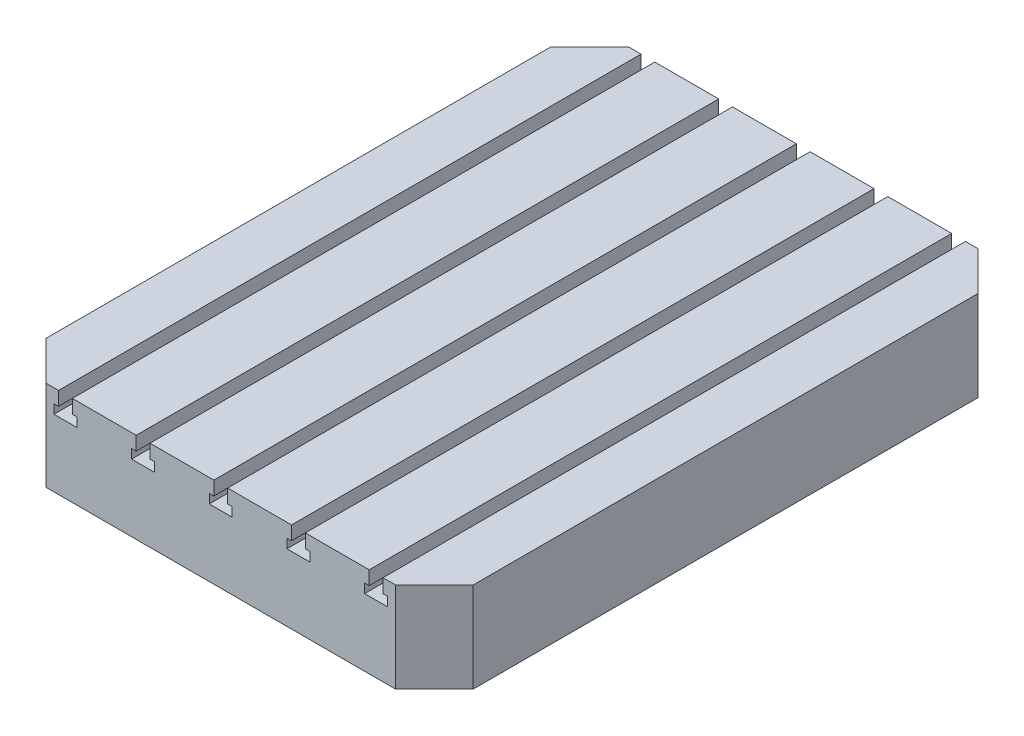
ISO-10303-21;
HEADER;
FILE_DESCRIPTION(('STEP AP214'),'2;1');
FILE_NAME('part.step','',(''),(''),'','','');
FILE_SCHEMA(('AUTOMOTIVE_DESIGN { 1 0 10303 214 1 1 1 1 }'));
ENDSEC;
DATA;
#1=APPLICATION_CONTEXT('core data for automotive mechanical design processes');
#2=APPLICATION_PROTOCOL_DEFINITION('international standard','automotive_design',2000,#1);
#3=PRODUCT_CONTEXT('',#1,'mechanical');
#4=PRODUCT('Part','Part','',(#3));
#5=PRODUCT_RELATED_PRODUCT_CATEGORY('part','',(#4));
#6=PRODUCT_DEFINITION_FORMATION('','',#4);
#7=PRODUCT_DEFINITION_CONTEXT('part definition',#1,'design');
#8=PRODUCT_DEFINITION('design','',#6,#7);
#9=PRODUCT_DEFINITION_SHAPE('','',#8);
#10=(LENGTH_UNIT() NAMED_UNIT(*) SI_UNIT(.MILLI.,.METRE.));
#11=(NAMED_UNIT(*) PLANE_ANGLE_UNIT() SI_UNIT($,.RADIAN.));
#12=(NAMED_UNIT(*) SI_UNIT($,.STERADIAN.) SOLID_ANGLE_UNIT());
#13=UNCERTAINTY_MEASURE_WITH_UNIT(LENGTH_MEASURE(1.E-05),#10,'distance_accuracy_value','');
#14=(GEOMETRIC_REPRESENTATION_CONTEXT(3) GLOBAL_UNCERTAINTY_ASSIGNED_CONTEXT((#13)) GLOBAL_UNIT_ASSIGNED_CONTEXT((#10,
#11,#12)) REPRESENTATION_CONTEXT('',''));
#15=CARTESIAN_POINT('',(0.,0.,0.));
#16=DIRECTION('',(0.,0.,1.));
#17=DIRECTION('',(1.,0.,0.));
#18=AXIS2_PLACEMENT_3D('',#15,#16,#17);
#19=CARTESIAN_POINT('',(-279.4,0.,-381.));
#20=DIRECTION('',(0.,-1.,0.));
#21=DIRECTION('',(0.,0.,-1.));
#22=AXIS2_PLACEMENT_3D('',#19,#20,#21);
#23=PLANE('',#22);
#24=DIRECTION('',(1.,0.,0.));
#25=VECTOR('',#24,1.);
#26=CARTESIAN_POINT('',(-279.4,0.,381.));
#27=LINE('',#26,#25);
#28=CARTESIAN_POINT('',(110.6,0.,381.));
#29=VERTEX_POINT('',#28);
#30=CARTESIAN_POINT('',(194.2,0.,381.));
#31=VERTEX_POINT('',#30);
#32=EDGE_CURVE('E877',#29,#31,#27,.T.);
#33=ORIENTED_EDGE('',*,*,#32,.T.);
#34=DIRECTION('',(0.,0.,1.));
#35=VECTOR('',#34,1.);
#36=CARTESIAN_POINT('',(194.2,0.,-381.));
#37=LINE('',#36,#35);
#38=CARTESIAN_POINT('',(194.2,0.,-381.));
#39=VERTEX_POINT('',#38);
#40=EDGE_CURVE('E422',#39,#31,#37,.T.);
#41=ORIENTED_EDGE('',*,*,#40,.F.);
#42=DIRECTION('',(-1.,0.,0.));
#43=VECTOR('',#42,1.);
#44=CARTESIAN_POINT('',(-279.4,0.,-381.));
#45=LINE('',#44,#43);
#46=CARTESIAN_POINT('',(110.6,0.,-381.));
#47=VERTEX_POINT('',#46);
#48=EDGE_CURVE('E376',#39,#47,#45,.T.);
#49=ORIENTED_EDGE('',*,*,#48,.T.);
#50=DIRECTION('',(0.,0.,1.));
#51=VECTOR('',#50,1.);
#52=CARTESIAN_POINT('',(110.6,0.,-381.));
#53=LINE('',#52,#51);
#54=EDGE_CURVE('E501',#47,#29,#53,.T.);
#55=ORIENTED_EDGE('',*,*,#54,.T.);
#56=EDGE_LOOP('',(#33,#41,#49,#55));
#57=FACE_BOUND('',#56,.T.);
#58=ADVANCED_FACE('F42',(#57),#23,.F.);
#59=CARTESIAN_POINT('',(9.00000000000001,0.,381.));
#60=VERTEX_POINT('',#59);
#61=CARTESIAN_POINT('',(92.6,0.,381.));
#62=VERTEX_POINT('',#61);
#63=EDGE_CURVE('E880',#60,#62,#27,.T.);
#64=ORIENTED_EDGE('',*,*,#63,.T.);
#65=DIRECTION('',(0.,0.,1.));
#66=VECTOR('',#65,1.);
#67=CARTESIAN_POINT('',(92.6,0.,-381.));
#68=LINE('',#67,#66);
#69=CARTESIAN_POINT('',(92.6,0.,-381.));
#70=VERTEX_POINT('',#69);
#71=EDGE_CURVE('E497',#70,#62,#68,.T.);
#72=ORIENTED_EDGE('',*,*,#71,.F.);
#73=CARTESIAN_POINT('',(8.99999999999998,0.,-381.));
#74=VERTEX_POINT('',#73);
#75=EDGE_CURVE('E915',#70,#74,#45,.T.);
#76=ORIENTED_EDGE('',*,*,#75,.T.);
#77=DIRECTION('',(0.,0.,1.));
#78=VECTOR('',#77,1.);
#79=CARTESIAN_POINT('',(8.99999999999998,0.,-381.));
#80=LINE('',#79,#78);
#81=EDGE_CURVE('E581',#74,#60,#80,.T.);
#82=ORIENTED_EDGE('',*,*,#81,.T.);
#83=EDGE_LOOP('',(#64,#72,#76,#82));
#84=FACE_BOUND('',#83,.T.);
#85=ADVANCED_FACE('F960',(#84),#23,.F.);
#86=CARTESIAN_POINT('',(-92.6,0.,381.));
#87=VERTEX_POINT('',#86);
#88=CARTESIAN_POINT('',(-9.00000000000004,0.,381.));
#89=VERTEX_POINT('',#88);
#90=EDGE_CURVE('E885',#87,#89,#27,.T.);
#91=ORIENTED_EDGE('',*,*,#90,.T.);
#92=DIRECTION('',(0.,0.,1.));
#93=VECTOR('',#92,1.);
#94=CARTESIAN_POINT('',(-9.00000000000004,0.,-381.));
#95=LINE('',#94,#93);
#96=CARTESIAN_POINT('',(-9.00000000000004,0.,-381.));
#97=VERTEX_POINT('',#96);
#98=EDGE_CURVE('E577',#97,#89,#95,.T.);
#99=ORIENTED_EDGE('',*,*,#98,.F.);
#100=CARTESIAN_POINT('',(-92.6,0.,-381.));
#101=VERTEX_POINT('',#100);
#102=EDGE_CURVE('E913',#97,#101,#45,.T.);
#103=ORIENTED_EDGE('',*,*,#102,.T.);
#104=DIRECTION('',(0.,0.,1.));
#105=VECTOR('',#104,1.);
#106=CARTESIAN_POINT('',(-92.6,0.,-381.));
#107=LINE('',#106,#105);
#108=EDGE_CURVE('E661',#101,#87,#107,.T.);
#109=ORIENTED_EDGE('',*,*,#108,.T.);
#110=EDGE_LOOP('',(#91,#99,#103,#109));
#111=FACE_BOUND('',#110,.T.);
#112=ADVANCED_FACE('F965',(#111),#23,.F.);
#113=CARTESIAN_POINT('',(-194.2,0.,381.));
#114=VERTEX_POINT('',#113);
#115=CARTESIAN_POINT('',(-110.6,0.,381.));
#116=VERTEX_POINT('',#115);
#117=EDGE_CURVE('E788',#114,#116,#27,.T.);
#118=ORIENTED_EDGE('',*,*,#117,.T.);
#119=DIRECTION('',(0.,0.,1.));
#120=VECTOR('',#119,1.);
#121=CARTESIAN_POINT('',(-110.6,0.,-381.));
#122=LINE('',#121,#120);
#123=CARTESIAN_POINT('',(-110.6,0.,-381.));
#124=VERTEX_POINT('',#123);
#125=EDGE_CURVE('E657',#124,#116,#122,.T.);
#126=ORIENTED_EDGE('',*,*,#125,.F.);
#127=CARTESIAN_POINT('',(-194.2,0.,-381.));
#128=VERTEX_POINT('',#127);
#129=EDGE_CURVE('E910',#124,#128,#45,.T.);
#130=ORIENTED_EDGE('',*,*,#129,.T.);
#131=DIRECTION('',(0.,0.,1.));
#132=VECTOR('',#131,1.);
#133=CARTESIAN_POINT('',(-194.2,0.,-381.));
#134=LINE('',#133,#132);
#135=EDGE_CURVE('E742',#128,#114,#134,.T.);
#136=ORIENTED_EDGE('',*,*,#135,.T.);
#137=EDGE_LOOP('',(#118,#126,#130,#136));
#138=FACE_BOUND('',#137,.T.);
#139=ADVANCED_FACE('F899',(#138),#23,.F.);
#140=CARTESIAN_POINT('',(-212.2,0.,-381.));
#141=VERTEX_POINT('',#140);
#142=CARTESIAN_POINT('',(-228.6,0.,-381.));
#143=VERTEX_POINT('',#142);
#144=EDGE_CURVE('E792',#141,#143,#45,.T.);
#145=ORIENTED_EDGE('',*,*,#144,.T.);
#146=DIRECTION('',(0.707106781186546,0.,-0.707106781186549));
#147=VECTOR('',#146,1.);
#148=CARTESIAN_POINT('',(-228.6,0.,-381.));
#149=LINE('',#148,#147);
#150=CARTESIAN_POINT('',(-279.4,0.,-330.2));
#151=VERTEX_POINT('',#150);
#152=EDGE_CURVE('E804',#143,#151,#149,.F.);
#153=ORIENTED_EDGE('',*,*,#152,.T.);
#154=DIRECTION('',(0.,0.,1.));
#155=VECTOR('',#154,1.);
#156=CARTESIAN_POINT('',(-279.4,0.,381.));
#157=LINE('',#156,#155);
#158=CARTESIAN_POINT('',(-279.4,0.,330.2));
#159=VERTEX_POINT('',#158);
#160=EDGE_CURVE('E741',#151,#159,#157,.T.);
#161=ORIENTED_EDGE('',*,*,#160,.T.);
#162=DIRECTION('',(-0.707106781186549,0.,-0.707106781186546));
#163=VECTOR('',#162,1.);
#164=CARTESIAN_POINT('',(-279.4,0.,330.2));
#165=LINE('',#164,#163);
#166=CARTESIAN_POINT('',(-228.6,0.,381.));
#167=VERTEX_POINT('',#166);
#168=EDGE_CURVE('E801',#159,#167,#165,.F.);
#169=ORIENTED_EDGE('',*,*,#168,.T.);
#170=CARTESIAN_POINT('',(-212.2,0.,381.));
#171=VERTEX_POINT('',#170);
#172=EDGE_CURVE('E784',#167,#171,#27,.T.);
#173=ORIENTED_EDGE('',*,*,#172,.T.);
#174=DIRECTION('',(0.,0.,1.));
#175=VECTOR('',#174,1.);
#176=CARTESIAN_POINT('',(-212.2,0.,-381.));
#177=LINE('',#176,#175);
#178=EDGE_CURVE('E737',#141,#171,#177,.T.);
#179=ORIENTED_EDGE('',*,*,#178,.F.);
#180=EDGE_LOOP('',(#145,#153,#161,#169,#173,#179));
#181=FACE_BOUND('',#180,.T.);
#182=ADVANCED_FACE('F856',(#181),#23,.F.);
#183=CARTESIAN_POINT('',(-279.4,-118.,381.));
#184=DIRECTION('',(-1.,0.,0.));
#185=DIRECTION('',(0.,0.,1.));
#186=AXIS2_PLACEMENT_3D('',#183,#184,#185);
#187=PLANE('',#186);
#188=ORIENTED_EDGE('',*,*,#160,.F.);
#189=DIRECTION('',(0.,-1.,0.));
#190=VECTOR('',#189,1.);
#191=CARTESIAN_POINT('',(-279.4,-118.,-330.2));
#192=LINE('',#191,#190);
#193=CARTESIAN_POINT('',(-279.4,-118.,-330.2));
#194=VERTEX_POINT('',#193);
#195=EDGE_CURVE('E811',#151,#194,#192,.T.);
#196=ORIENTED_EDGE('',*,*,#195,.T.);
#197=DIRECTION('',(0.,0.,1.));
#198=VECTOR('',#197,1.);
#199=CARTESIAN_POINT('',(-279.4,-118.,381.));
#200=LINE('',#199,#198);
#201=CARTESIAN_POINT('',(-279.4,-118.,330.2));
#202=VERTEX_POINT('',#201);
#203=EDGE_CURVE('E763',#194,#202,#200,.T.);
#204=ORIENTED_EDGE('',*,*,#203,.T.);
#205=DIRECTION('',(0.,1.,0.));
#206=VECTOR('',#205,1.);
#207=CARTESIAN_POINT('',(-279.4,-118.,330.2));
#208=LINE('',#207,#206);
#209=EDGE_CURVE('E807',#202,#159,#208,.T.);
#210=ORIENTED_EDGE('',*,*,#209,.T.);
#211=EDGE_LOOP('',(#188,#196,#204,#210));
#212=FACE_BOUND('',#211,.T.);
#213=ADVANCED_FACE('F852',(#212),#187,.T.);
#214=CARTESIAN_POINT('',(-279.4,-118.,-381.));
#215=DIRECTION('',(0.,0.,-1.));
#216=DIRECTION('',(-1.,0.,0.));
#217=AXIS2_PLACEMENT_3D('',#214,#215,#216);
#218=PLANE('',#217);
#219=DIRECTION('',(-1.,0.,0.));
#220=VECTOR('',#219,1.);
#221=CARTESIAN_POINT('',(-279.4,-118.,-381.));
#222=LINE('',#221,#220);
#223=CARTESIAN_POINT('',(228.6,-118.,-381.));
#224=VERTEX_POINT('',#223);
#225=CARTESIAN_POINT('',(-228.6,-118.,-381.));
#226=VERTEX_POINT('',#225);
#227=EDGE_CURVE('E776',#224,#226,#222,.T.);
#228=ORIENTED_EDGE('',*,*,#227,.T.);
#229=DIRECTION('',(0.,1.,0.));
#230=VECTOR('',#229,1.);
#231=CARTESIAN_POINT('',(-228.6,-118.,-381.));
#232=LINE('',#231,#230);
#233=EDGE_CURVE('E797',#226,#143,#232,.T.);
#234=ORIENTED_EDGE('',*,*,#233,.T.);
#235=ORIENTED_EDGE('',*,*,#144,.F.);
#236=DIRECTION('',(0.,-1.,0.));
#237=VECTOR('',#236,1.);
#238=CARTESIAN_POINT('',(-212.2,0.,-381.));
#239=LINE('',#238,#237);
#240=CARTESIAN_POINT('',(-212.2,-18.,-381.));
#241=VERTEX_POINT('',#240);
#242=EDGE_CURVE('E682',#141,#241,#239,.T.);
#243=ORIENTED_EDGE('',*,*,#242,.T.);
#244=DIRECTION('',(-1.,0.,0.));
#245=VECTOR('',#244,1.);
#246=CARTESIAN_POINT('',(-212.2,-18.,-381.));
#247=LINE('',#246,#245);
#248=CARTESIAN_POINT('',(-218.2,-18.,-381.));
#249=VERTEX_POINT('',#248);
#250=EDGE_CURVE('E686',#241,#249,#247,.T.);
#251=ORIENTED_EDGE('',*,*,#250,.T.);
#252=DIRECTION('',(0.,-1.,0.));
#253=VECTOR('',#252,1.);
#254=CARTESIAN_POINT('',(-218.2,-18.,-381.));
#255=LINE('',#254,#253);
#256=CARTESIAN_POINT('',(-218.2,-30.,-381.));
#257=VERTEX_POINT('',#256);
#258=EDGE_CURVE('E691',#249,#257,#255,.T.);
#259=ORIENTED_EDGE('',*,*,#258,.T.);
#260=DIRECTION('',(1.,0.,0.));
#261=VECTOR('',#260,1.);
#262=CARTESIAN_POINT('',(-218.2,-30.,-381.));
#263=LINE('',#262,#261);
#264=CARTESIAN_POINT('',(-188.2,-30.,-381.));
#265=VERTEX_POINT('',#264);
#266=EDGE_CURVE('E695',#257,#265,#263,.T.);
#267=ORIENTED_EDGE('',*,*,#266,.T.);
#268=DIRECTION('',(0.,1.,0.));
#269=VECTOR('',#268,1.);
#270=CARTESIAN_POINT('',(-188.2,-18.,-381.));
#271=LINE('',#270,#269);
#272=CARTESIAN_POINT('',(-188.2,-18.,-381.));
#273=VERTEX_POINT('',#272);
#274=EDGE_CURVE('E699',#265,#273,#271,.T.);
#275=ORIENTED_EDGE('',*,*,#274,.T.);
#276=DIRECTION('',(-1.,0.,0.));
#277=VECTOR('',#276,1.);
#278=CARTESIAN_POINT('',(-194.2,-18.,-381.));
#279=LINE('',#278,#277);
#280=CARTESIAN_POINT('',(-194.2,-18.,-381.));
#281=VERTEX_POINT('',#280);
#282=EDGE_CURVE('E703',#273,#281,#279,.T.);
#283=ORIENTED_EDGE('',*,*,#282,.T.);
#284=DIRECTION('',(0.,1.,0.));
#285=VECTOR('',#284,1.);
#286=CARTESIAN_POINT('',(-194.2,0.,-381.));
#287=LINE('',#286,#285);
#288=EDGE_CURVE('E707',#281,#128,#287,.T.);
#289=ORIENTED_EDGE('',*,*,#288,.T.);
#290=ORIENTED_EDGE('',*,*,#129,.F.);
#291=DIRECTION('',(0.,-1.,0.));
#292=VECTOR('',#291,1.);
#293=CARTESIAN_POINT('',(-110.6,0.,-381.));
#294=LINE('',#293,#292);
#295=CARTESIAN_POINT('',(-110.6,-18.,-381.));
#296=VERTEX_POINT('',#295);
#297=EDGE_CURVE('E602',#124,#296,#294,.T.);
#298=ORIENTED_EDGE('',*,*,#297,.T.);
#299=DIRECTION('',(-1.,0.,0.));
#300=VECTOR('',#299,1.);
#301=CARTESIAN_POINT('',(-110.6,-18.,-381.));
#302=LINE('',#301,#300);
#303=CARTESIAN_POINT('',(-116.6,-18.,-381.));
#304=VERTEX_POINT('',#303);
#305=EDGE_CURVE('E606',#296,#304,#302,.T.);
#306=ORIENTED_EDGE('',*,*,#305,.T.);
#307=DIRECTION('',(0.,-1.,0.));
#308=VECTOR('',#307,1.);
#309=CARTESIAN_POINT('',(-116.6,-18.,-381.));
#310=LINE('',#309,#308);
#311=CARTESIAN_POINT('',(-116.6,-30.,-381.));
#312=VERTEX_POINT('',#311);
#313=EDGE_CURVE('E611',#304,#312,#310,.T.);
#314=ORIENTED_EDGE('',*,*,#313,.T.);
#315=DIRECTION('',(1.,0.,0.));
#316=VECTOR('',#315,1.);
#317=CARTESIAN_POINT('',(-116.6,-30.,-381.));
#318=LINE('',#317,#316);
#319=CARTESIAN_POINT('',(-86.6,-30.,-381.));
#320=VERTEX_POINT('',#319);
#321=EDGE_CURVE('E615',#312,#320,#318,.T.);
#322=ORIENTED_EDGE('',*,*,#321,.T.);
#323=DIRECTION('',(0.,1.,0.));
#324=VECTOR('',#323,1.);
#325=CARTESIAN_POINT('',(-86.6,-18.,-381.));
#326=LINE('',#325,#324);
#327=CARTESIAN_POINT('',(-86.6,-18.,-381.));
#328=VERTEX_POINT('',#327);
#329=EDGE_CURVE('E619',#320,#328,#326,.T.);
#330=ORIENTED_EDGE('',*,*,#329,.T.);
#331=DIRECTION('',(-1.,0.,0.));
#332=VECTOR('',#331,1.);
#333=CARTESIAN_POINT('',(-92.6,-18.,-381.));
#334=LINE('',#333,#332);
#335=CARTESIAN_POINT('',(-92.6,-18.,-381.));
#336=VERTEX_POINT('',#335);
#337=EDGE_CURVE('E623',#328,#336,#334,.T.);
#338=ORIENTED_EDGE('',*,*,#337,.T.);
#339=DIRECTION('',(0.,1.,0.));
#340=VECTOR('',#339,1.);
#341=CARTESIAN_POINT('',(-92.6,0.,-381.));
#342=LINE('',#341,#340);
#343=EDGE_CURVE('E627',#336,#101,#342,.T.);
#344=ORIENTED_EDGE('',*,*,#343,.T.);
#345=ORIENTED_EDGE('',*,*,#102,.F.);
#346=DIRECTION('',(0.,-1.,0.));
#347=VECTOR('',#346,1.);
#348=CARTESIAN_POINT('',(-9.00000000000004,0.,-381.));
#349=LINE('',#348,#347);
#350=CARTESIAN_POINT('',(-9.00000000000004,-18.,-381.));
#351=VERTEX_POINT('',#350);
#352=EDGE_CURVE('E522',#97,#351,#349,.T.);
#353=ORIENTED_EDGE('',*,*,#352,.T.);
#354=DIRECTION('',(-1.,0.,0.));
#355=VECTOR('',#354,1.);
#356=CARTESIAN_POINT('',(-9.00000000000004,-18.,-381.));
#357=LINE('',#356,#355);
#358=CARTESIAN_POINT('',(-15.,-18.,-381.));
#359=VERTEX_POINT('',#358);
#360=EDGE_CURVE('E526',#351,#359,#357,.T.);
#361=ORIENTED_EDGE('',*,*,#360,.T.);
#362=DIRECTION('',(0.,-1.,0.));
#363=VECTOR('',#362,1.);
#364=CARTESIAN_POINT('',(-15.,-18.,-381.));
#365=LINE('',#364,#363);
#366=CARTESIAN_POINT('',(-15.,-30.,-381.));
#367=VERTEX_POINT('',#366);
#368=EDGE_CURVE('E531',#359,#367,#365,.T.);
#369=ORIENTED_EDGE('',*,*,#368,.T.);
#370=DIRECTION('',(1.,0.,0.));
#371=VECTOR('',#370,1.);
#372=CARTESIAN_POINT('',(-15.,-30.,-381.));
#373=LINE('',#372,#371);
#374=CARTESIAN_POINT('',(15.,-30.,-381.));
#375=VERTEX_POINT('',#374);
#376=EDGE_CURVE('E535',#367,#375,#373,.T.);
#377=ORIENTED_EDGE('',*,*,#376,.T.);
#378=DIRECTION('',(0.,1.,0.));
#379=VECTOR('',#378,1.);
#380=CARTESIAN_POINT('',(15.,-18.,-381.));
#381=LINE('',#380,#379);
#382=CARTESIAN_POINT('',(15.,-18.,-381.));
#383=VERTEX_POINT('',#382);
#384=EDGE_CURVE('E539',#375,#383,#381,.T.);
#385=ORIENTED_EDGE('',*,*,#384,.T.);
#386=DIRECTION('',(-1.,0.,0.));
#387=VECTOR('',#386,1.);
#388=CARTESIAN_POINT('',(8.99999999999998,-18.,-381.));
#389=LINE('',#388,#387);
#390=CARTESIAN_POINT('',(8.99999999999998,-18.,-381.));
#391=VERTEX_POINT('',#390);
#392=EDGE_CURVE('E543',#383,#391,#389,.T.);
#393=ORIENTED_EDGE('',*,*,#392,.T.);
#394=DIRECTION('',(0.,1.,0.));
#395=VECTOR('',#394,1.);
#396=CARTESIAN_POINT('',(8.99999999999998,0.,-381.));
#397=LINE('',#396,#395);
#398=EDGE_CURVE('E547',#391,#74,#397,.T.);
#399=ORIENTED_EDGE('',*,*,#398,.T.);
#400=ORIENTED_EDGE('',*,*,#75,.F.);
#401=DIRECTION('',(0.,-1.,0.));
#402=VECTOR('',#401,1.);
#403=CARTESIAN_POINT('',(92.6,0.,-381.));
#404=LINE('',#403,#402);
#405=CARTESIAN_POINT('',(92.6,-18.,-381.));
#406=VERTEX_POINT('',#405);
#407=EDGE_CURVE('E444',#70,#406,#404,.T.);
#408=ORIENTED_EDGE('',*,*,#407,.T.);
#409=DIRECTION('',(-1.,0.,0.));
#410=VECTOR('',#409,1.);
#411=CARTESIAN_POINT('',(92.6,-18.,-381.));
#412=LINE('',#411,#410);
#413=CARTESIAN_POINT('',(86.6,-18.,-381.));
#414=VERTEX_POINT('',#413);
#415=EDGE_CURVE('E448',#406,#414,#412,.T.);
#416=ORIENTED_EDGE('',*,*,#415,.T.);
#417=DIRECTION('',(0.,-1.,0.));
#418=VECTOR('',#417,1.);
#419=CARTESIAN_POINT('',(86.6,-18.,-381.));
#420=LINE('',#419,#418);
#421=CARTESIAN_POINT('',(86.6,-30.,-381.));
#422=VERTEX_POINT('',#421);
#423=EDGE_CURVE('E452',#414,#422,#420,.T.);
#424=ORIENTED_EDGE('',*,*,#423,.T.);
#425=DIRECTION('',(1.,0.,0.));
#426=VECTOR('',#425,1.);
#427=CARTESIAN_POINT('',(86.6,-30.,-381.));
#428=LINE('',#427,#426);
#429=CARTESIAN_POINT('',(116.6,-30.,-381.));
#430=VERTEX_POINT('',#429);
#431=EDGE_CURVE('E456',#422,#430,#428,.T.);
#432=ORIENTED_EDGE('',*,*,#431,.T.);
#433=DIRECTION('',(0.,1.,0.));
#434=VECTOR('',#433,1.);
#435=CARTESIAN_POINT('',(116.6,-18.,-381.));
#436=LINE('',#435,#434);
#437=CARTESIAN_POINT('',(116.6,-18.,-381.));
#438=VERTEX_POINT('',#437);
#439=EDGE_CURVE('E460',#430,#438,#436,.T.);
#440=ORIENTED_EDGE('',*,*,#439,.T.);
#441=DIRECTION('',(-1.,0.,0.));
#442=VECTOR('',#441,1.);
#443=CARTESIAN_POINT('',(110.6,-18.,-381.));
#444=LINE('',#443,#442);
#445=CARTESIAN_POINT('',(110.6,-18.,-381.));
#446=VERTEX_POINT('',#445);
#447=EDGE_CURVE('E464',#438,#446,#444,.T.);
#448=ORIENTED_EDGE('',*,*,#447,.T.);
#449=DIRECTION('',(0.,1.,0.));
#450=VECTOR('',#449,1.);
#451=CARTESIAN_POINT('',(110.6,0.,-381.));
#452=LINE('',#451,#450);
#453=EDGE_CURVE('E468',#446,#47,#452,.T.);
#454=ORIENTED_EDGE('',*,*,#453,.T.);
#455=ORIENTED_EDGE('',*,*,#48,.F.);
#456=DIRECTION('',(0.,-1.,0.));
#457=VECTOR('',#456,1.);
#458=CARTESIAN_POINT('',(194.2,0.,-381.));
#459=LINE('',#458,#457);
#460=CARTESIAN_POINT('',(194.2,-18.,-381.));
#461=VERTEX_POINT('',#460);
#462=EDGE_CURVE('E352',#39,#461,#459,.T.);
#463=ORIENTED_EDGE('',*,*,#462,.T.);
#464=DIRECTION('',(-1.,0.,0.));
#465=VECTOR('',#464,1.);
#466=CARTESIAN_POINT('',(194.2,-18.,-381.));
#467=LINE('',#466,#465);
#468=CARTESIAN_POINT('',(188.2,-18.,-381.));
#469=VERTEX_POINT('',#468);
#470=EDGE_CURVE('E364',#461,#469,#467,.T.);
#471=ORIENTED_EDGE('',*,*,#470,.T.);
#472=DIRECTION('',(0.,-1.,0.));
#473=VECTOR('',#472,1.);
#474=CARTESIAN_POINT('',(188.2,-18.,-381.));
#475=LINE('',#474,#473);
#476=CARTESIAN_POINT('',(188.2,-30.,-381.));
#477=VERTEX_POINT('',#476);
#478=EDGE_CURVE('E370',#469,#477,#475,.T.);
#479=ORIENTED_EDGE('',*,*,#478,.T.);
#480=DIRECTION('',(1.,0.,0.));
#481=VECTOR('',#480,1.);
#482=CARTESIAN_POINT('',(188.2,-30.,-381.));
#483=LINE('',#482,#481);
#484=CARTESIAN_POINT('',(218.2,-30.,-381.));
#485=VERTEX_POINT('',#484);
#486=EDGE_CURVE('E388',#477,#485,#483,.T.);
#487=ORIENTED_EDGE('',*,*,#486,.T.);
#488=DIRECTION('',(0.,1.,0.));
#489=VECTOR('',#488,1.);
#490=CARTESIAN_POINT('',(218.2,-18.,-381.));
#491=LINE('',#490,#489);
#492=CARTESIAN_POINT('',(218.2,-18.,-381.));
#493=VERTEX_POINT('',#492);
#494=EDGE_CURVE('E392',#485,#493,#491,.T.);
#495=ORIENTED_EDGE('',*,*,#494,.T.);
#496=DIRECTION('',(-1.,0.,0.));
#497=VECTOR('',#496,1.);
#498=CARTESIAN_POINT('',(212.2,-18.,-381.));
#499=LINE('',#498,#497);
#500=CARTESIAN_POINT('',(212.2,-18.,-381.));
#501=VERTEX_POINT('',#500);
#502=EDGE_CURVE('E396',#493,#501,#499,.T.);
#503=ORIENTED_EDGE('',*,*,#502,.T.);
#504=DIRECTION('',(0.,1.,0.));
#505=VECTOR('',#504,1.);
#506=CARTESIAN_POINT('',(212.2,0.,-381.));
#507=LINE('',#506,#505);
#508=CARTESIAN_POINT('',(212.2,0.,-381.));
#509=VERTEX_POINT('',#508);
#510=EDGE_CURVE('E361',#501,#509,#507,.T.);
#511=ORIENTED_EDGE('',*,*,#510,.T.);
#512=CARTESIAN_POINT('',(228.6,0.,-381.));
#513=VERTEX_POINT('',#512);
#514=EDGE_CURVE('E768',#513,#509,#45,.T.);
#515=ORIENTED_EDGE('',*,*,#514,.F.);
#516=DIRECTION('',(0.,-1.,0.));
#517=VECTOR('',#516,1.);
#518=CARTESIAN_POINT('',(228.6,-118.,-381.));
#519=LINE('',#518,#517);
#520=EDGE_CURVE('E779',#513,#224,#519,.T.);
#521=ORIENTED_EDGE('',*,*,#520,.T.);
#522=EDGE_LOOP('',(#228,#234,#235,#243,#251,#259,#267,#275,#283,#289,#290,#298,#306,#314,#322,
#330,#338,#344,#345,#353,#361,#369,#377,#385,#393,#399,#400,#408,#416,#424,#432,#440,#448,#454,
#455,#463,#471,#479,#487,#495,#503,#511,#515,#521));
#523=FACE_BOUND('',#522,.T.);
#524=ADVANCED_FACE('F374',(#523),#218,.T.);
#525=CARTESIAN_POINT('',(279.4,-118.,381.));
#526=DIRECTION('',(1.,0.,0.));
#527=DIRECTION('',(0.,0.,-1.));
#528=AXIS2_PLACEMENT_3D('',#525,#526,#527);
#529=PLANE('',#528);
#530=DIRECTION('',(0.,0.,-1.));
#531=VECTOR('',#530,1.);
#532=CARTESIAN_POINT('',(279.4,-118.,381.));
#533=LINE('',#532,#531);
#534=CARTESIAN_POINT('',(279.4,-118.,330.2));
#535=VERTEX_POINT('',#534);
#536=CARTESIAN_POINT('',(279.4,-118.,-330.2));
#537=VERTEX_POINT('',#536);
#538=EDGE_CURVE('E772',#535,#537,#533,.T.);
#539=ORIENTED_EDGE('',*,*,#538,.T.);
#540=DIRECTION('',(0.,1.,0.));
#541=VECTOR('',#540,1.);
#542=CARTESIAN_POINT('',(279.4,-118.,-330.2));
#543=LINE('',#542,#541);
#544=CARTESIAN_POINT('',(279.4,0.,-330.2));
#545=VERTEX_POINT('',#544);
#546=EDGE_CURVE('E829',#537,#545,#543,.T.);
#547=ORIENTED_EDGE('',*,*,#546,.T.);
#548=DIRECTION('',(0.,0.,-1.));
#549=VECTOR('',#548,1.);
#550=CARTESIAN_POINT('',(279.4,0.,381.));
#551=LINE('',#550,#549);
#552=CARTESIAN_POINT('',(279.4,0.,330.2));
#553=VERTEX_POINT('',#552);
#554=EDGE_CURVE('E787',#553,#545,#551,.T.);
#555=ORIENTED_EDGE('',*,*,#554,.F.);
#556=DIRECTION('',(0.,-1.,0.));
#557=VECTOR('',#556,1.);
#558=CARTESIAN_POINT('',(279.4,-118.,330.2));
#559=LINE('',#558,#557);
#560=EDGE_CURVE('E826',#553,#535,#559,.T.);
#561=ORIENTED_EDGE('',*,*,#560,.T.);
#562=EDGE_LOOP('',(#539,#547,#555,#561));
#563=FACE_BOUND('',#562,.T.);
#564=ADVANCED_FACE('F869',(#563),#529,.T.);
#565=CARTESIAN_POINT('',(-279.4,-118.,381.));
#566=DIRECTION('',(0.,0.,1.));
#567=DIRECTION('',(1.,0.,0.));
#568=AXIS2_PLACEMENT_3D('',#565,#566,#567);
#569=PLANE('',#568);
#570=DIRECTION('',(1.,0.,0.));
#571=VECTOR('',#570,1.);
#572=CARTESIAN_POINT('',(-279.4,-118.,381.));
#573=LINE('',#572,#571);
#574=CARTESIAN_POINT('',(-228.6,-118.,381.));
#575=VERTEX_POINT('',#574);
#576=CARTESIAN_POINT('',(228.6,-118.,381.));
#577=VERTEX_POINT('',#576);
#578=EDGE_CURVE('E767',#575,#577,#573,.T.);
#579=ORIENTED_EDGE('',*,*,#578,.T.);
#580=DIRECTION('',(0.,1.,0.));
#581=VECTOR('',#580,1.);
#582=CARTESIAN_POINT('',(228.6,-118.,381.));
#583=LINE('',#582,#581);
#584=CARTESIAN_POINT('',(228.6,0.,381.));
#585=VERTEX_POINT('',#584);
#586=EDGE_CURVE('E11',#577,#585,#583,.T.);
#587=ORIENTED_EDGE('',*,*,#586,.T.);
#588=CARTESIAN_POINT('',(212.2,0.,381.));
#589=VERTEX_POINT('',#588);
#590=EDGE_CURVE('E783',#589,#585,#27,.T.);
#591=ORIENTED_EDGE('',*,*,#590,.F.);
#592=DIRECTION('',(0.,1.,0.));
#593=VECTOR('',#592,1.);
#594=CARTESIAN_POINT('',(212.2,0.,381.));
#595=LINE('',#594,#593);
#596=CARTESIAN_POINT('',(212.2,-18.,381.));
#597=VERTEX_POINT('',#596);
#598=EDGE_CURVE('E378',#597,#589,#595,.T.);
#599=ORIENTED_EDGE('',*,*,#598,.F.);
#600=DIRECTION('',(-1.,0.,0.));
#601=VECTOR('',#600,1.);
#602=CARTESIAN_POINT('',(212.2,-18.,381.));
#603=LINE('',#602,#601);
#604=CARTESIAN_POINT('',(218.2,-18.,381.));
#605=VERTEX_POINT('',#604);
#606=EDGE_CURVE('E383',#605,#597,#603,.T.);
#607=ORIENTED_EDGE('',*,*,#606,.F.);
#608=DIRECTION('',(0.,1.,0.));
#609=VECTOR('',#608,1.);
#610=CARTESIAN_POINT('',(218.2,-18.,381.));
#611=LINE('',#610,#609);
#612=CARTESIAN_POINT('',(218.2,-30.,381.));
#613=VERTEX_POINT('',#612);
#614=EDGE_CURVE('E416',#613,#605,#611,.T.);
#615=ORIENTED_EDGE('',*,*,#614,.F.);
#616=DIRECTION('',(1.,0.,0.));
#617=VECTOR('',#616,1.);
#618=CARTESIAN_POINT('',(188.2,-30.,381.));
#619=LINE('',#618,#617);
#620=CARTESIAN_POINT('',(188.2,-30.,381.));
#621=VERTEX_POINT('',#620);
#622=EDGE_CURVE('E412',#621,#613,#619,.T.);
#623=ORIENTED_EDGE('',*,*,#622,.F.);
#624=DIRECTION('',(0.,-1.,0.));
#625=VECTOR('',#624,1.);
#626=CARTESIAN_POINT('',(188.2,-18.,381.));
#627=LINE('',#626,#625);
#628=CARTESIAN_POINT('',(188.2,-18.,381.));
#629=VERTEX_POINT('',#628);
#630=EDGE_CURVE('E408',#629,#621,#627,.T.);
#631=ORIENTED_EDGE('',*,*,#630,.F.);
#632=DIRECTION('',(-1.,0.,0.));
#633=VECTOR('',#632,1.);
#634=CARTESIAN_POINT('',(194.2,-18.,381.));
#635=LINE('',#634,#633);
#636=CARTESIAN_POINT('',(194.2,-18.,381.));
#637=VERTEX_POINT('',#636);
#638=EDGE_CURVE('E405',#637,#629,#635,.T.);
#639=ORIENTED_EDGE('',*,*,#638,.F.);
#640=DIRECTION('',(0.,-1.,0.));
#641=VECTOR('',#640,1.);
#642=CARTESIAN_POINT('',(194.2,0.,381.));
#643=LINE('',#642,#641);
#644=EDGE_CURVE('E355',#31,#637,#643,.T.);
#645=ORIENTED_EDGE('',*,*,#644,.F.);
#646=ORIENTED_EDGE('',*,*,#32,.F.);
#647=DIRECTION('',(0.,1.,0.));
#648=VECTOR('',#647,1.);
#649=CARTESIAN_POINT('',(110.6,0.,381.));
#650=LINE('',#649,#648);
#651=CARTESIAN_POINT('',(110.6,-18.,381.));
#652=VERTEX_POINT('',#651);
#653=EDGE_CURVE('E449',#652,#29,#650,.T.);
#654=ORIENTED_EDGE('',*,*,#653,.F.);
#655=DIRECTION('',(-1.,0.,0.));
#656=VECTOR('',#655,1.);
#657=CARTESIAN_POINT('',(110.6,-18.,381.));
#658=LINE('',#657,#656);
#659=CARTESIAN_POINT('',(116.6,-18.,381.));
#660=VERTEX_POINT('',#659);
#661=EDGE_CURVE('E491',#660,#652,#658,.T.);
#662=ORIENTED_EDGE('',*,*,#661,.F.);
#663=DIRECTION('',(0.,1.,0.));
#664=VECTOR('',#663,1.);
#665=CARTESIAN_POINT('',(116.6,-18.,381.));
#666=LINE('',#665,#664);
#667=CARTESIAN_POINT('',(116.6,-30.,381.));
#668=VERTEX_POINT('',#667);
#669=EDGE_CURVE('E487',#668,#660,#666,.T.);
#670=ORIENTED_EDGE('',*,*,#669,.F.);
#671=DIRECTION('',(1.,0.,0.));
#672=VECTOR('',#671,1.);
#673=CARTESIAN_POINT('',(86.6,-30.,381.));
#674=LINE('',#673,#672);
#675=CARTESIAN_POINT('',(86.6,-30.,381.));
#676=VERTEX_POINT('',#675);
#677=EDGE_CURVE('E483',#676,#668,#674,.T.);
#678=ORIENTED_EDGE('',*,*,#677,.F.);
#679=DIRECTION('',(0.,-1.,0.));
#680=VECTOR('',#679,1.);
#681=CARTESIAN_POINT('',(86.6,-18.,381.));
#682=LINE('',#681,#680);
#683=CARTESIAN_POINT('',(86.6,-18.,381.));
#684=VERTEX_POINT('',#683);
#685=EDGE_CURVE('E479',#684,#676,#682,.T.);
#686=ORIENTED_EDGE('',*,*,#685,.F.);
#687=DIRECTION('',(-1.,0.,0.));
#688=VECTOR('',#687,1.);
#689=CARTESIAN_POINT('',(92.6,-18.,381.));
#690=LINE('',#689,#688);
#691=CARTESIAN_POINT('',(92.6,-18.,381.));
#692=VERTEX_POINT('',#691);
#693=EDGE_CURVE('E475',#692,#684,#690,.T.);
#694=ORIENTED_EDGE('',*,*,#693,.F.);
#695=DIRECTION('',(0.,-1.,0.));
#696=VECTOR('',#695,1.);
#697=CARTESIAN_POINT('',(92.6,0.,381.));
#698=LINE('',#697,#696);
#699=EDGE_CURVE('E425',#62,#692,#698,.T.);
#700=ORIENTED_EDGE('',*,*,#699,.F.);
#701=ORIENTED_EDGE('',*,*,#63,.F.);
#702=DIRECTION('',(0.,1.,0.));
#703=VECTOR('',#702,1.);
#704=CARTESIAN_POINT('',(8.99999999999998,0.,381.));
#705=LINE('',#704,#703);
#706=CARTESIAN_POINT('',(8.99999999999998,-18.,381.));
#707=VERTEX_POINT('',#706);
#708=EDGE_CURVE('E527',#707,#60,#705,.T.);
#709=ORIENTED_EDGE('',*,*,#708,.F.);
#710=DIRECTION('',(-1.,0.,0.));
#711=VECTOR('',#710,1.);
#712=CARTESIAN_POINT('',(8.99999999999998,-18.,381.));
#713=LINE('',#712,#711);
#714=CARTESIAN_POINT('',(15.,-18.,381.));
#715=VERTEX_POINT('',#714);
#716=EDGE_CURVE('E571',#715,#707,#713,.T.);
#717=ORIENTED_EDGE('',*,*,#716,.F.);
#718=DIRECTION('',(0.,1.,0.));
#719=VECTOR('',#718,1.);
#720=CARTESIAN_POINT('',(15.,-18.,381.));
#721=LINE('',#720,#719);
#722=CARTESIAN_POINT('',(15.,-30.,381.));
#723=VERTEX_POINT('',#722);
#724=EDGE_CURVE('E567',#723,#715,#721,.T.);
#725=ORIENTED_EDGE('',*,*,#724,.F.);
#726=DIRECTION('',(1.,0.,0.));
#727=VECTOR('',#726,1.);
#728=CARTESIAN_POINT('',(-15.,-30.,381.));
#729=LINE('',#728,#727);
#730=CARTESIAN_POINT('',(-15.,-30.,381.));
#731=VERTEX_POINT('',#730);
#732=EDGE_CURVE('E563',#731,#723,#729,.T.);
#733=ORIENTED_EDGE('',*,*,#732,.F.);
#734=DIRECTION('',(0.,-1.,0.));
#735=VECTOR('',#734,1.);
#736=CARTESIAN_POINT('',(-15.,-18.,381.));
#737=LINE('',#736,#735);
#738=CARTESIAN_POINT('',(-15.,-18.,381.));
#739=VERTEX_POINT('',#738);
#740=EDGE_CURVE('E559',#739,#731,#737,.T.);
#741=ORIENTED_EDGE('',*,*,#740,.F.);
#742=DIRECTION('',(-1.,0.,0.));
#743=VECTOR('',#742,1.);
#744=CARTESIAN_POINT('',(-9.00000000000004,-18.,381.));
#745=LINE('',#744,#743);
#746=CARTESIAN_POINT('',(-9.00000000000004,-18.,381.));
#747=VERTEX_POINT('',#746);
#748=EDGE_CURVE('E555',#747,#739,#745,.T.);
#749=ORIENTED_EDGE('',*,*,#748,.F.);
#750=DIRECTION('',(0.,-1.,0.));
#751=VECTOR('',#750,1.);
#752=CARTESIAN_POINT('',(-9.00000000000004,0.,381.));
#753=LINE('',#752,#751);
#754=EDGE_CURVE('E500',#89,#747,#753,.T.);
#755=ORIENTED_EDGE('',*,*,#754,.F.);
#756=ORIENTED_EDGE('',*,*,#90,.F.);
#757=DIRECTION('',(0.,1.,0.));
#758=VECTOR('',#757,1.);
#759=CARTESIAN_POINT('',(-92.6,0.,381.));
#760=LINE('',#759,#758);
#761=CARTESIAN_POINT('',(-92.6,-18.,381.));
#762=VERTEX_POINT('',#761);
#763=EDGE_CURVE('E607',#762,#87,#760,.T.);
#764=ORIENTED_EDGE('',*,*,#763,.F.);
#765=DIRECTION('',(-1.,0.,0.));
#766=VECTOR('',#765,1.);
#767=CARTESIAN_POINT('',(-92.6,-18.,381.));
#768=LINE('',#767,#766);
#769=CARTESIAN_POINT('',(-86.6,-18.,381.));
#770=VERTEX_POINT('',#769);
#771=EDGE_CURVE('E651',#770,#762,#768,.T.);
#772=ORIENTED_EDGE('',*,*,#771,.F.);
#773=DIRECTION('',(0.,1.,0.));
#774=VECTOR('',#773,1.);
#775=CARTESIAN_POINT('',(-86.6,-18.,381.));
#776=LINE('',#775,#774);
#777=CARTESIAN_POINT('',(-86.6,-30.,381.));
#778=VERTEX_POINT('',#777);
#779=EDGE_CURVE('E647',#778,#770,#776,.T.);
#780=ORIENTED_EDGE('',*,*,#779,.F.);
#781=DIRECTION('',(1.,0.,0.));
#782=VECTOR('',#781,1.);
#783=CARTESIAN_POINT('',(-116.6,-30.,381.));
#784=LINE('',#783,#782);
#785=CARTESIAN_POINT('',(-116.6,-30.,381.));
#786=VERTEX_POINT('',#785);
#787=EDGE_CURVE('E643',#786,#778,#784,.T.);
#788=ORIENTED_EDGE('',*,*,#787,.F.);
#789=DIRECTION('',(0.,-1.,0.));
#790=VECTOR('',#789,1.);
#791=CARTESIAN_POINT('',(-116.6,-18.,381.));
#792=LINE('',#791,#790);
#793=CARTESIAN_POINT('',(-116.6,-18.,381.));
#794=VERTEX_POINT('',#793);
#795=EDGE_CURVE('E639',#794,#786,#792,.T.);
#796=ORIENTED_EDGE('',*,*,#795,.F.);
#797=DIRECTION('',(-1.,0.,0.));
#798=VECTOR('',#797,1.);
#799=CARTESIAN_POINT('',(-110.6,-18.,381.));
#800=LINE('',#799,#798);
#801=CARTESIAN_POINT('',(-110.6,-18.,381.));
#802=VERTEX_POINT('',#801);
#803=EDGE_CURVE('E635',#802,#794,#800,.T.);
#804=ORIENTED_EDGE('',*,*,#803,.F.);
#805=DIRECTION('',(0.,-1.,0.));
#806=VECTOR('',#805,1.);
#807=CARTESIAN_POINT('',(-110.6,0.,381.));
#808=LINE('',#807,#806);
#809=EDGE_CURVE('E580',#116,#802,#808,.T.);
#810=ORIENTED_EDGE('',*,*,#809,.F.);
#811=ORIENTED_EDGE('',*,*,#117,.F.);
#812=DIRECTION('',(0.,1.,0.));
#813=VECTOR('',#812,1.);
#814=CARTESIAN_POINT('',(-194.2,0.,381.));
#815=LINE('',#814,#813);
#816=CARTESIAN_POINT('',(-194.2,-18.,381.));
#817=VERTEX_POINT('',#816);
#818=EDGE_CURVE('E687',#817,#114,#815,.T.);
#819=ORIENTED_EDGE('',*,*,#818,.F.);
#820=DIRECTION('',(-1.,0.,0.));
#821=VECTOR('',#820,1.);
#822=CARTESIAN_POINT('',(-194.2,-18.,381.));
#823=LINE('',#822,#821);
#824=CARTESIAN_POINT('',(-188.2,-18.,381.));
#825=VERTEX_POINT('',#824);
#826=EDGE_CURVE('E731',#825,#817,#823,.T.);
#827=ORIENTED_EDGE('',*,*,#826,.F.);
#828=DIRECTION('',(0.,1.,0.));
#829=VECTOR('',#828,1.);
#830=CARTESIAN_POINT('',(-188.2,-18.,381.));
#831=LINE('',#830,#829);
#832=CARTESIAN_POINT('',(-188.2,-30.,381.));
#833=VERTEX_POINT('',#832);
#834=EDGE_CURVE('E727',#833,#825,#831,.T.);
#835=ORIENTED_EDGE('',*,*,#834,.F.);
#836=DIRECTION('',(1.,0.,0.));
#837=VECTOR('',#836,1.);
#838=CARTESIAN_POINT('',(-218.2,-30.,381.));
#839=LINE('',#838,#837);
#840=CARTESIAN_POINT('',(-218.2,-30.,381.));
#841=VERTEX_POINT('',#840);
#842=EDGE_CURVE('E723',#841,#833,#839,.T.);
#843=ORIENTED_EDGE('',*,*,#842,.F.);
#844=DIRECTION('',(0.,-1.,0.));
#845=VECTOR('',#844,1.);
#846=CARTESIAN_POINT('',(-218.2,-18.,381.));
#847=LINE('',#846,#845);
#848=CARTESIAN_POINT('',(-218.2,-18.,381.));
#849=VERTEX_POINT('',#848);
#850=EDGE_CURVE('E719',#849,#841,#847,.T.);
#851=ORIENTED_EDGE('',*,*,#850,.F.);
#852=DIRECTION('',(-1.,0.,0.));
#853=VECTOR('',#852,1.);
#854=CARTESIAN_POINT('',(-212.2,-18.,381.));
#855=LINE('',#854,#853);
#856=CARTESIAN_POINT('',(-212.2,-18.,381.));
#857=VERTEX_POINT('',#856);
#858=EDGE_CURVE('E715',#857,#849,#855,.T.);
#859=ORIENTED_EDGE('',*,*,#858,.F.);
#860=DIRECTION('',(0.,-1.,0.));
#861=VECTOR('',#860,1.);
#862=CARTESIAN_POINT('',(-212.2,0.,381.));
#863=LINE('',#862,#861);
#864=EDGE_CURVE('E660',#171,#857,#863,.T.);
#865=ORIENTED_EDGE('',*,*,#864,.F.);
#866=ORIENTED_EDGE('',*,*,#172,.F.);
#867=DIRECTION('',(0.,-1.,0.));
#868=VECTOR('',#867,1.);
#869=CARTESIAN_POINT('',(-228.6,-118.,381.));
#870=LINE('',#869,#868);
#871=EDGE_CURVE('E51',#167,#575,#870,.T.);
#872=ORIENTED_EDGE('',*,*,#871,.T.);
#873=EDGE_LOOP('',(#579,#587,#591,#599,#607,#615,#623,#631,#639,#645,#646,#654,#662,#670,#678,
#686,#694,#700,#701,#709,#717,#725,#733,#741,#749,#755,#756,#764,#772,#780,#788,#796,#804,#810,
#811,#819,#827,#835,#843,#851,#859,#865,#866,#872));
#874=FACE_BOUND('',#873,.T.);
#875=ADVANCED_FACE('F840',(#874),#569,.T.);
#876=CARTESIAN_POINT('',(-279.4,-118.,-381.));
#877=DIRECTION('',(0.,-1.,0.));
#878=DIRECTION('',(0.,0.,-1.));
#879=AXIS2_PLACEMENT_3D('',#876,#877,#878);
#880=PLANE('',#879);
#881=ORIENTED_EDGE('',*,*,#203,.F.);
#882=DIRECTION('',(-0.707106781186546,0.,0.707106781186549));
#883=VECTOR('',#882,1.);
#884=CARTESIAN_POINT('',(-254.,-118.,-355.6));
#885=LINE('',#884,#883);
#886=EDGE_CURVE('E823',#194,#226,#885,.F.);
#887=ORIENTED_EDGE('',*,*,#886,.T.);
#888=ORIENTED_EDGE('',*,*,#227,.F.);
#889=DIRECTION('',(-0.707106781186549,0.,-0.707106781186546));
#890=VECTOR('',#889,1.);
#891=CARTESIAN_POINT('',(-25.4000000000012,-118.,-635.));
#892=LINE('',#891,#890);
#893=EDGE_CURVE('E820',#224,#537,#892,.F.);
#894=ORIENTED_EDGE('',*,*,#893,.T.);
#895=ORIENTED_EDGE('',*,*,#538,.F.);
#896=DIRECTION('',(0.707106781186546,0.,-0.707106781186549));
#897=VECTOR('',#896,1.);
#898=CARTESIAN_POINT('',(355.600000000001,-118.,253.999999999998));
#899=LINE('',#898,#897);
#900=EDGE_CURVE('E817',#535,#577,#899,.F.);
#901=ORIENTED_EDGE('',*,*,#900,.T.);
#902=ORIENTED_EDGE('',*,*,#578,.F.);
#903=DIRECTION('',(0.707106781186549,0.,0.707106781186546));
#904=VECTOR('',#903,1.);
#905=CARTESIAN_POINT('',(-635.,-118.,-25.3999999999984));
#906=LINE('',#905,#904);
#907=EDGE_CURVE('E814',#575,#202,#906,.F.);
#908=ORIENTED_EDGE('',*,*,#907,.T.);
#909=EDGE_LOOP('',(#881,#887,#888,#894,#895,#901,#902,#908));
#910=FACE_BOUND('',#909,.T.);
#911=ADVANCED_FACE('F846',(#910),#880,.T.);
#912=ORIENTED_EDGE('',*,*,#554,.T.);
#913=DIRECTION('',(0.707106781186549,0.,0.707106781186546));
#914=VECTOR('',#913,1.);
#915=CARTESIAN_POINT('',(279.4,0.,-330.2));
#916=LINE('',#915,#914);
#917=EDGE_CURVE('E65',#545,#513,#916,.F.);
#918=ORIENTED_EDGE('',*,*,#917,.T.);
#919=ORIENTED_EDGE('',*,*,#514,.T.);
#920=DIRECTION('',(0.,0.,1.));
#921=VECTOR('',#920,1.);
#922=CARTESIAN_POINT('',(212.2,0.,-381.));
#923=LINE('',#922,#921);
#924=EDGE_CURVE('E426',#509,#589,#923,.T.);
#925=ORIENTED_EDGE('',*,*,#924,.T.);
#926=ORIENTED_EDGE('',*,*,#590,.T.);
#927=DIRECTION('',(-0.707106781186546,0.,0.707106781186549));
#928=VECTOR('',#927,1.);
#929=CARTESIAN_POINT('',(228.6,0.,381.));
#930=LINE('',#929,#928);
#931=EDGE_CURVE('E58',#585,#553,#930,.F.);
#932=ORIENTED_EDGE('',*,*,#931,.T.);
#933=EDGE_LOOP('',(#912,#918,#919,#925,#926,#932));
#934=FACE_BOUND('',#933,.T.);
#935=ADVANCED_FACE('F871',(#934),#23,.F.);
#936=CARTESIAN_POINT('',(-212.2,0.,-381.));
#937=DIRECTION('',(-1.,0.,0.));
#938=DIRECTION('',(0.,0.,1.));
#939=AXIS2_PLACEMENT_3D('',#936,#937,#938);
#940=PLANE('',#939);
#941=ORIENTED_EDGE('',*,*,#864,.T.);
#942=DIRECTION('',(0.,0.,1.));
#943=VECTOR('',#942,1.);
#944=CARTESIAN_POINT('',(-212.2,-18.,-381.));
#945=LINE('',#944,#943);
#946=EDGE_CURVE('E711',#241,#857,#945,.T.);
#947=ORIENTED_EDGE('',*,*,#946,.F.);
#948=ORIENTED_EDGE('',*,*,#242,.F.);
#949=ORIENTED_EDGE('',*,*,#178,.T.);
#950=EDGE_LOOP('',(#941,#947,#948,#949));
#951=FACE_BOUND('',#950,.T.);
#952=ADVANCED_FACE('F969',(#951),#940,.F.);
#953=CARTESIAN_POINT('',(-194.2,0.,-381.));
#954=DIRECTION('',(1.,0.,0.));
#955=DIRECTION('',(0.,0.,-1.));
#956=AXIS2_PLACEMENT_3D('',#953,#954,#955);
#957=PLANE('',#956);
#958=ORIENTED_EDGE('',*,*,#818,.T.);
#959=ORIENTED_EDGE('',*,*,#135,.F.);
#960=ORIENTED_EDGE('',*,*,#288,.F.);
#961=DIRECTION('',(0.,0.,1.));
#962=VECTOR('',#961,1.);
#963=CARTESIAN_POINT('',(-194.2,-18.,-381.));
#964=LINE('',#963,#962);
#965=EDGE_CURVE('E746',#281,#817,#964,.T.);
#966=ORIENTED_EDGE('',*,*,#965,.T.);
#967=EDGE_LOOP('',(#958,#959,#960,#966));
#968=FACE_BOUND('',#967,.T.);
#969=ADVANCED_FACE('F974',(#968),#957,.F.);
#970=CARTESIAN_POINT('',(-194.2,-18.,-381.));
#971=DIRECTION('',(0.,1.,0.));
#972=DIRECTION('',(-1.,0.,0.));
#973=AXIS2_PLACEMENT_3D('',#970,#971,#972);
#974=PLANE('',#973);
#975=ORIENTED_EDGE('',*,*,#826,.T.);
#976=ORIENTED_EDGE('',*,*,#965,.F.);
#977=ORIENTED_EDGE('',*,*,#282,.F.);
#978=DIRECTION('',(0.,0.,1.));
#979=VECTOR('',#978,1.);
#980=CARTESIAN_POINT('',(-188.2,-18.,-381.));
#981=LINE('',#980,#979);
#982=EDGE_CURVE('E749',#273,#825,#981,.T.);
#983=ORIENTED_EDGE('',*,*,#982,.T.);
#984=EDGE_LOOP('',(#975,#976,#977,#983));
#985=FACE_BOUND('',#984,.T.);
#986=ADVANCED_FACE('F1017',(#985),#974,.F.);
#987=CARTESIAN_POINT('',(-188.2,-18.,-381.));
#988=DIRECTION('',(1.,0.,0.));
#989=DIRECTION('',(0.,0.,-1.));
#990=AXIS2_PLACEMENT_3D('',#987,#988,#989);
#991=PLANE('',#990);
#992=ORIENTED_EDGE('',*,*,#834,.T.);
#993=ORIENTED_EDGE('',*,*,#982,.F.);
#994=ORIENTED_EDGE('',*,*,#274,.F.);
#995=DIRECTION('',(0.,0.,1.));
#996=VECTOR('',#995,1.);
#997=CARTESIAN_POINT('',(-188.2,-30.,-381.));
#998=LINE('',#997,#996);
#999=EDGE_CURVE('E752',#265,#833,#998,.T.);
#1000=ORIENTED_EDGE('',*,*,#999,.T.);
#1001=EDGE_LOOP('',(#992,#993,#994,#1000));
#1002=FACE_BOUND('',#1001,.T.);
#1003=ADVANCED_FACE('F1027',(#1002),#991,.F.);
#1004=CARTESIAN_POINT('',(-218.2,-30.,-381.));
#1005=DIRECTION('',(0.,-1.,0.));
#1006=DIRECTION('',(1.,0.,0.));
#1007=AXIS2_PLACEMENT_3D('',#1004,#1005,#1006);
#1008=PLANE('',#1007);
#1009=ORIENTED_EDGE('',*,*,#842,.T.);
#1010=ORIENTED_EDGE('',*,*,#999,.F.);
#1011=ORIENTED_EDGE('',*,*,#266,.F.);
#1012=DIRECTION('',(0.,0.,1.));
#1013=VECTOR('',#1012,1.);
#1014=CARTESIAN_POINT('',(-218.2,-30.,-381.));
#1015=LINE('',#1014,#1013);
#1016=EDGE_CURVE('E755',#257,#841,#1015,.T.);
#1017=ORIENTED_EDGE('',*,*,#1016,.T.);
#1018=EDGE_LOOP('',(#1009,#1010,#1011,#1017));
#1019=FACE_BOUND('',#1018,.T.);
#1020=ADVANCED_FACE('F1037',(#1019),#1008,.F.);
#1021=CARTESIAN_POINT('',(-218.2,-18.,-381.));
#1022=DIRECTION('',(-1.,0.,0.));
#1023=DIRECTION('',(0.,0.,1.));
#1024=AXIS2_PLACEMENT_3D('',#1021,#1022,#1023);
#1025=PLANE('',#1024);
#1026=ORIENTED_EDGE('',*,*,#850,.T.);
#1027=ORIENTED_EDGE('',*,*,#1016,.F.);
#1028=ORIENTED_EDGE('',*,*,#258,.F.);
#1029=DIRECTION('',(0.,0.,1.));
#1030=VECTOR('',#1029,1.);
#1031=CARTESIAN_POINT('',(-218.2,-18.,-381.));
#1032=LINE('',#1031,#1030);
#1033=EDGE_CURVE('E758',#249,#849,#1032,.T.);
#1034=ORIENTED_EDGE('',*,*,#1033,.T.);
#1035=EDGE_LOOP('',(#1026,#1027,#1028,#1034));
#1036=FACE_BOUND('',#1035,.T.);
#1037=ADVANCED_FACE('F1047',(#1036),#1025,.F.);
#1038=CARTESIAN_POINT('',(-212.2,-18.,-381.));
#1039=DIRECTION('',(0.,1.,0.));
#1040=DIRECTION('',(-1.,0.,0.));
#1041=AXIS2_PLACEMENT_3D('',#1038,#1039,#1040);
#1042=PLANE('',#1041);
#1043=ORIENTED_EDGE('',*,*,#858,.T.);
#1044=ORIENTED_EDGE('',*,*,#1033,.F.);
#1045=ORIENTED_EDGE('',*,*,#250,.F.);
#1046=ORIENTED_EDGE('',*,*,#946,.T.);
#1047=EDGE_LOOP('',(#1043,#1044,#1045,#1046));
#1048=FACE_BOUND('',#1047,.T.);
#1049=ADVANCED_FACE('F1057',(#1048),#1042,.F.);
#1050=CARTESIAN_POINT('',(-110.6,0.,-381.));
#1051=DIRECTION('',(-1.,0.,0.));
#1052=DIRECTION('',(0.,0.,1.));
#1053=AXIS2_PLACEMENT_3D('',#1050,#1051,#1052);
#1054=PLANE('',#1053);
#1055=ORIENTED_EDGE('',*,*,#809,.T.);
#1056=DIRECTION('',(0.,0.,1.));
#1057=VECTOR('',#1056,1.);
#1058=CARTESIAN_POINT('',(-110.6,-18.,-381.));
#1059=LINE('',#1058,#1057);
#1060=EDGE_CURVE('E631',#296,#802,#1059,.T.);
#1061=ORIENTED_EDGE('',*,*,#1060,.F.);
#1062=ORIENTED_EDGE('',*,*,#297,.F.);
#1063=ORIENTED_EDGE('',*,*,#125,.T.);
#1064=EDGE_LOOP('',(#1055,#1061,#1062,#1063));
#1065=FACE_BOUND('',#1064,.T.);
#1066=ADVANCED_FACE('F908',(#1065),#1054,.F.);
#1067=CARTESIAN_POINT('',(-92.6,0.,-381.));
#1068=DIRECTION('',(1.,0.,0.));
#1069=DIRECTION('',(0.,0.,-1.));
#1070=AXIS2_PLACEMENT_3D('',#1067,#1068,#1069);
#1071=PLANE('',#1070);
#1072=ORIENTED_EDGE('',*,*,#763,.T.);
#1073=ORIENTED_EDGE('',*,*,#108,.F.);
#1074=ORIENTED_EDGE('',*,*,#343,.F.);
#1075=DIRECTION('',(0.,0.,1.));
#1076=VECTOR('',#1075,1.);
#1077=CARTESIAN_POINT('',(-92.6,-18.,-381.));
#1078=LINE('',#1077,#1076);
#1079=EDGE_CURVE('E665',#336,#762,#1078,.T.);
#1080=ORIENTED_EDGE('',*,*,#1079,.T.);
#1081=EDGE_LOOP('',(#1072,#1073,#1074,#1080));
#1082=FACE_BOUND('',#1081,.T.);
#1083=ADVANCED_FACE('F1076',(#1082),#1071,.F.);
#1084=CARTESIAN_POINT('',(-92.6,-18.,-381.));
#1085=DIRECTION('',(0.,1.,0.));
#1086=DIRECTION('',(-1.,0.,0.));
#1087=AXIS2_PLACEMENT_3D('',#1084,#1085,#1086);
#1088=PLANE('',#1087);
#1089=ORIENTED_EDGE('',*,*,#771,.T.);
#1090=ORIENTED_EDGE('',*,*,#1079,.F.);
#1091=ORIENTED_EDGE('',*,*,#337,.F.);
#1092=DIRECTION('',(0.,0.,1.));
#1093=VECTOR('',#1092,1.);
#1094=CARTESIAN_POINT('',(-86.6,-18.,-381.));
#1095=LINE('',#1094,#1093);
#1096=EDGE_CURVE('E668',#328,#770,#1095,.T.);
#1097=ORIENTED_EDGE('',*,*,#1096,.T.);
#1098=EDGE_LOOP('',(#1089,#1090,#1091,#1097));
#1099=FACE_BOUND('',#1098,.T.);
#1100=ADVANCED_FACE('F1085',(#1099),#1088,.F.);
#1101=CARTESIAN_POINT('',(-86.6,-18.,-381.));
#1102=DIRECTION('',(1.,0.,0.));
#1103=DIRECTION('',(0.,0.,-1.));
#1104=AXIS2_PLACEMENT_3D('',#1101,#1102,#1103);
#1105=PLANE('',#1104);
#1106=ORIENTED_EDGE('',*,*,#779,.T.);
#1107=ORIENTED_EDGE('',*,*,#1096,.F.);
#1108=ORIENTED_EDGE('',*,*,#329,.F.);
#1109=DIRECTION('',(0.,0.,1.));
#1110=VECTOR('',#1109,1.);
#1111=CARTESIAN_POINT('',(-86.6,-30.,-381.));
#1112=LINE('',#1111,#1110);
#1113=EDGE_CURVE('E671',#320,#778,#1112,.T.);
#1114=ORIENTED_EDGE('',*,*,#1113,.T.);
#1115=EDGE_LOOP('',(#1106,#1107,#1108,#1114));
#1116=FACE_BOUND('',#1115,.T.);
#1117=ADVANCED_FACE('F1095',(#1116),#1105,.F.);
#1118=CARTESIAN_POINT('',(-116.6,-30.,-381.));
#1119=DIRECTION('',(0.,-1.,0.));
#1120=DIRECTION('',(1.,0.,0.));
#1121=AXIS2_PLACEMENT_3D('',#1118,#1119,#1120);
#1122=PLANE('',#1121);
#1123=ORIENTED_EDGE('',*,*,#787,.T.);
#1124=ORIENTED_EDGE('',*,*,#1113,.F.);
#1125=ORIENTED_EDGE('',*,*,#321,.F.);
#1126=DIRECTION('',(0.,0.,1.));
#1127=VECTOR('',#1126,1.);
#1128=CARTESIAN_POINT('',(-116.6,-30.,-381.));
#1129=LINE('',#1128,#1127);
#1130=EDGE_CURVE('E674',#312,#786,#1129,.T.);
#1131=ORIENTED_EDGE('',*,*,#1130,.T.);
#1132=EDGE_LOOP('',(#1123,#1124,#1125,#1131));
#1133=FACE_BOUND('',#1132,.T.);
#1134=ADVANCED_FACE('F1105',(#1133),#1122,.F.);
#1135=CARTESIAN_POINT('',(-116.6,-18.,-381.));
#1136=DIRECTION('',(-1.,0.,0.));
#1137=DIRECTION('',(0.,0.,1.));
#1138=AXIS2_PLACEMENT_3D('',#1135,#1136,#1137);
#1139=PLANE('',#1138);
#1140=ORIENTED_EDGE('',*,*,#795,.T.);
#1141=ORIENTED_EDGE('',*,*,#1130,.F.);
#1142=ORIENTED_EDGE('',*,*,#313,.F.);
#1143=DIRECTION('',(0.,0.,1.));
#1144=VECTOR('',#1143,1.);
#1145=CARTESIAN_POINT('',(-116.6,-18.,-381.));
#1146=LINE('',#1145,#1144);
#1147=EDGE_CURVE('E677',#304,#794,#1146,.T.);
#1148=ORIENTED_EDGE('',*,*,#1147,.T.);
#1149=EDGE_LOOP('',(#1140,#1141,#1142,#1148));
#1150=FACE_BOUND('',#1149,.T.);
#1151=ADVANCED_FACE('F1115',(#1150),#1139,.F.);
#1152=CARTESIAN_POINT('',(-110.6,-18.,-381.));
#1153=DIRECTION('',(0.,1.,0.));
#1154=DIRECTION('',(-1.,0.,0.));
#1155=AXIS2_PLACEMENT_3D('',#1152,#1153,#1154);
#1156=PLANE('',#1155);
#1157=ORIENTED_EDGE('',*,*,#803,.T.);
#1158=ORIENTED_EDGE('',*,*,#1147,.F.);
#1159=ORIENTED_EDGE('',*,*,#305,.F.);
#1160=ORIENTED_EDGE('',*,*,#1060,.T.);
#1161=EDGE_LOOP('',(#1157,#1158,#1159,#1160));
#1162=FACE_BOUND('',#1161,.T.);
#1163=ADVANCED_FACE('F1125',(#1162),#1156,.F.);
#1164=CARTESIAN_POINT('',(-9.00000000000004,0.,-381.));
#1165=DIRECTION('',(-1.,0.,0.));
#1166=DIRECTION('',(0.,0.,1.));
#1167=AXIS2_PLACEMENT_3D('',#1164,#1165,#1166);
#1168=PLANE('',#1167);
#1169=ORIENTED_EDGE('',*,*,#754,.T.);
#1170=DIRECTION('',(0.,0.,1.));
#1171=VECTOR('',#1170,1.);
#1172=CARTESIAN_POINT('',(-9.00000000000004,-18.,-381.));
#1173=LINE('',#1172,#1171);
#1174=EDGE_CURVE('E551',#351,#747,#1173,.T.);
#1175=ORIENTED_EDGE('',*,*,#1174,.F.);
#1176=ORIENTED_EDGE('',*,*,#352,.F.);
#1177=ORIENTED_EDGE('',*,*,#98,.T.);
#1178=EDGE_LOOP('',(#1169,#1175,#1176,#1177));
#1179=FACE_BOUND('',#1178,.T.);
#1180=ADVANCED_FACE('F1135',(#1179),#1168,.F.);
#1181=CARTESIAN_POINT('',(8.99999999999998,0.,-381.));
#1182=DIRECTION('',(1.,0.,0.));
#1183=DIRECTION('',(0.,0.,-1.));
#1184=AXIS2_PLACEMENT_3D('',#1181,#1182,#1183);
#1185=PLANE('',#1184);
#1186=ORIENTED_EDGE('',*,*,#708,.T.);
#1187=ORIENTED_EDGE('',*,*,#81,.F.);
#1188=ORIENTED_EDGE('',*,*,#398,.F.);
#1189=DIRECTION('',(0.,0.,1.));
#1190=VECTOR('',#1189,1.);
#1191=CARTESIAN_POINT('',(8.99999999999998,-18.,-381.));
#1192=LINE('',#1191,#1190);
#1193=EDGE_CURVE('E585',#391,#707,#1192,.T.);
#1194=ORIENTED_EDGE('',*,*,#1193,.T.);
#1195=EDGE_LOOP('',(#1186,#1187,#1188,#1194));
#1196=FACE_BOUND('',#1195,.T.);
#1197=ADVANCED_FACE('F1145',(#1196),#1185,.F.);
#1198=CARTESIAN_POINT('',(8.99999999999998,-18.,-381.));
#1199=DIRECTION('',(0.,1.,0.));
#1200=DIRECTION('',(-1.,0.,0.));
#1201=AXIS2_PLACEMENT_3D('',#1198,#1199,#1200);
#1202=PLANE('',#1201);
#1203=ORIENTED_EDGE('',*,*,#716,.T.);
#1204=ORIENTED_EDGE('',*,*,#1193,.F.);
#1205=ORIENTED_EDGE('',*,*,#392,.F.);
#1206=DIRECTION('',(0.,0.,1.));
#1207=VECTOR('',#1206,1.);
#1208=CARTESIAN_POINT('',(15.,-18.,-381.));
#1209=LINE('',#1208,#1207);
#1210=EDGE_CURVE('E588',#383,#715,#1209,.T.);
#1211=ORIENTED_EDGE('',*,*,#1210,.T.);
#1212=EDGE_LOOP('',(#1203,#1204,#1205,#1211));
#1213=FACE_BOUND('',#1212,.T.);
#1214=ADVANCED_FACE('F1155',(#1213),#1202,.F.);
#1215=CARTESIAN_POINT('',(15.,-18.,-381.));
#1216=DIRECTION('',(1.,0.,0.));
#1217=DIRECTION('',(0.,0.,-1.));
#1218=AXIS2_PLACEMENT_3D('',#1215,#1216,#1217);
#1219=PLANE('',#1218);
#1220=ORIENTED_EDGE('',*,*,#724,.T.);
#1221=ORIENTED_EDGE('',*,*,#1210,.F.);
#1222=ORIENTED_EDGE('',*,*,#384,.F.);
#1223=DIRECTION('',(0.,0.,1.));
#1224=VECTOR('',#1223,1.);
#1225=CARTESIAN_POINT('',(15.,-30.,-381.));
#1226=LINE('',#1225,#1224);
#1227=EDGE_CURVE('E591',#375,#723,#1226,.T.);
#1228=ORIENTED_EDGE('',*,*,#1227,.T.);
#1229=EDGE_LOOP('',(#1220,#1221,#1222,#1228));
#1230=FACE_BOUND('',#1229,.T.);
#1231=ADVANCED_FACE('F1165',(#1230),#1219,.F.);
#1232=CARTESIAN_POINT('',(-15.,-30.,-381.));
#1233=DIRECTION('',(0.,-1.,0.));
#1234=DIRECTION('',(1.,0.,0.));
#1235=AXIS2_PLACEMENT_3D('',#1232,#1233,#1234);
#1236=PLANE('',#1235);
#1237=ORIENTED_EDGE('',*,*,#732,.T.);
#1238=ORIENTED_EDGE('',*,*,#1227,.F.);
#1239=ORIENTED_EDGE('',*,*,#376,.F.);
#1240=DIRECTION('',(0.,0.,1.));
#1241=VECTOR('',#1240,1.);
#1242=CARTESIAN_POINT('',(-15.,-30.,-381.));
#1243=LINE('',#1242,#1241);
#1244=EDGE_CURVE('E594',#367,#731,#1243,.T.);
#1245=ORIENTED_EDGE('',*,*,#1244,.T.);
#1246=EDGE_LOOP('',(#1237,#1238,#1239,#1245));
#1247=FACE_BOUND('',#1246,.T.);
#1248=ADVANCED_FACE('F1175',(#1247),#1236,.F.);
#1249=CARTESIAN_POINT('',(-15.,-18.,-381.));
#1250=DIRECTION('',(-1.,0.,0.));
#1251=DIRECTION('',(0.,0.,1.));
#1252=AXIS2_PLACEMENT_3D('',#1249,#1250,#1251);
#1253=PLANE('',#1252);
#1254=ORIENTED_EDGE('',*,*,#740,.T.);
#1255=ORIENTED_EDGE('',*,*,#1244,.F.);
#1256=ORIENTED_EDGE('',*,*,#368,.F.);
#1257=DIRECTION('',(0.,0.,1.));
#1258=VECTOR('',#1257,1.);
#1259=CARTESIAN_POINT('',(-15.,-18.,-381.));
#1260=LINE('',#1259,#1258);
#1261=EDGE_CURVE('E597',#359,#739,#1260,.T.);
#1262=ORIENTED_EDGE('',*,*,#1261,.T.);
#1263=EDGE_LOOP('',(#1254,#1255,#1256,#1262));
#1264=FACE_BOUND('',#1263,.T.);
#1265=ADVANCED_FACE('F1185',(#1264),#1253,.F.);
#1266=CARTESIAN_POINT('',(-9.00000000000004,-18.,-381.));
#1267=DIRECTION('',(0.,1.,0.));
#1268=DIRECTION('',(-1.,0.,0.));
#1269=AXIS2_PLACEMENT_3D('',#1266,#1267,#1268);
#1270=PLANE('',#1269);
#1271=ORIENTED_EDGE('',*,*,#748,.T.);
#1272=ORIENTED_EDGE('',*,*,#1261,.F.);
#1273=ORIENTED_EDGE('',*,*,#360,.F.);
#1274=ORIENTED_EDGE('',*,*,#1174,.T.);
#1275=EDGE_LOOP('',(#1271,#1272,#1273,#1274));
#1276=FACE_BOUND('',#1275,.T.);
#1277=ADVANCED_FACE('F1195',(#1276),#1270,.F.);
#1278=CARTESIAN_POINT('',(92.6,0.,-381.));
#1279=DIRECTION('',(-1.,0.,0.));
#1280=DIRECTION('',(0.,0.,1.));
#1281=AXIS2_PLACEMENT_3D('',#1278,#1279,#1280);
#1282=PLANE('',#1281);
#1283=ORIENTED_EDGE('',*,*,#699,.T.);
#1284=DIRECTION('',(0.,0.,1.));
#1285=VECTOR('',#1284,1.);
#1286=CARTESIAN_POINT('',(92.6,-18.,-381.));
#1287=LINE('',#1286,#1285);
#1288=EDGE_CURVE('E471',#406,#692,#1287,.T.);
#1289=ORIENTED_EDGE('',*,*,#1288,.F.);
#1290=ORIENTED_EDGE('',*,*,#407,.F.);
#1291=ORIENTED_EDGE('',*,*,#71,.T.);
#1292=EDGE_LOOP('',(#1283,#1289,#1290,#1291));
#1293=FACE_BOUND('',#1292,.T.);
#1294=ADVANCED_FACE('F1205',(#1293),#1282,.F.);
#1295=CARTESIAN_POINT('',(110.6,0.,-381.));
#1296=DIRECTION('',(1.,0.,0.));
#1297=DIRECTION('',(0.,0.,-1.));
#1298=AXIS2_PLACEMENT_3D('',#1295,#1296,#1297);
#1299=PLANE('',#1298);
#1300=ORIENTED_EDGE('',*,*,#653,.T.);
#1301=ORIENTED_EDGE('',*,*,#54,.F.);
#1302=ORIENTED_EDGE('',*,*,#453,.F.);
#1303=DIRECTION('',(0.,0.,1.));
#1304=VECTOR('',#1303,1.);
#1305=CARTESIAN_POINT('',(110.6,-18.,-381.));
#1306=LINE('',#1305,#1304);
#1307=EDGE_CURVE('E505',#446,#652,#1306,.T.);
#1308=ORIENTED_EDGE('',*,*,#1307,.T.);
#1309=EDGE_LOOP('',(#1300,#1301,#1302,#1308));
#1310=FACE_BOUND('',#1309,.T.);
#1311=ADVANCED_FACE('F924',(#1310),#1299,.F.);
#1312=CARTESIAN_POINT('',(110.6,-18.,-381.));
#1313=DIRECTION('',(0.,1.,0.));
#1314=DIRECTION('',(-1.,0.,0.));
#1315=AXIS2_PLACEMENT_3D('',#1312,#1313,#1314);
#1316=PLANE('',#1315);
#1317=ORIENTED_EDGE('',*,*,#661,.T.);
#1318=ORIENTED_EDGE('',*,*,#1307,.F.);
#1319=ORIENTED_EDGE('',*,*,#447,.F.);
#1320=DIRECTION('',(0.,0.,1.));
#1321=VECTOR('',#1320,1.);
#1322=CARTESIAN_POINT('',(116.6,-18.,-381.));
#1323=LINE('',#1322,#1321);
#1324=EDGE_CURVE('E508',#438,#660,#1323,.T.);
#1325=ORIENTED_EDGE('',*,*,#1324,.T.);
#1326=EDGE_LOOP('',(#1317,#1318,#1319,#1325));
#1327=FACE_BOUND('',#1326,.T.);
#1328=ADVANCED_FACE('F929',(#1327),#1316,.F.);
#1329=CARTESIAN_POINT('',(116.6,-18.,-381.));
#1330=DIRECTION('',(1.,0.,0.));
#1331=DIRECTION('',(0.,0.,-1.));
#1332=AXIS2_PLACEMENT_3D('',#1329,#1330,#1331);
#1333=PLANE('',#1332);
#1334=ORIENTED_EDGE('',*,*,#669,.T.);
#1335=ORIENTED_EDGE('',*,*,#1324,.F.);
#1336=ORIENTED_EDGE('',*,*,#439,.F.);
#1337=DIRECTION('',(0.,0.,1.));
#1338=VECTOR('',#1337,1.);
#1339=CARTESIAN_POINT('',(116.6,-30.,-381.));
#1340=LINE('',#1339,#1338);
#1341=EDGE_CURVE('E511',#430,#668,#1340,.T.);
#1342=ORIENTED_EDGE('',*,*,#1341,.T.);
#1343=EDGE_LOOP('',(#1334,#1335,#1336,#1342));
#1344=FACE_BOUND('',#1343,.T.);
#1345=ADVANCED_FACE('F1232',(#1344),#1333,.F.);
#1346=CARTESIAN_POINT('',(86.6,-30.,-381.));
#1347=DIRECTION('',(0.,-1.,0.));
#1348=DIRECTION('',(1.,0.,0.));
#1349=AXIS2_PLACEMENT_3D('',#1346,#1347,#1348);
#1350=PLANE('',#1349);
#1351=ORIENTED_EDGE('',*,*,#677,.T.);
#1352=ORIENTED_EDGE('',*,*,#1341,.F.);
#1353=ORIENTED_EDGE('',*,*,#431,.F.);
#1354=DIRECTION('',(0.,0.,1.));
#1355=VECTOR('',#1354,1.);
#1356=CARTESIAN_POINT('',(86.6,-30.,-381.));
#1357=LINE('',#1356,#1355);
#1358=EDGE_CURVE('E514',#422,#676,#1357,.T.);
#1359=ORIENTED_EDGE('',*,*,#1358,.T.);
#1360=EDGE_LOOP('',(#1351,#1352,#1353,#1359));
#1361=FACE_BOUND('',#1360,.T.);
#1362=ADVANCED_FACE('F1241',(#1361),#1350,.F.);
#1363=CARTESIAN_POINT('',(86.6,-18.,-381.));
#1364=DIRECTION('',(-1.,0.,0.));
#1365=DIRECTION('',(0.,0.,1.));
#1366=AXIS2_PLACEMENT_3D('',#1363,#1364,#1365);
#1367=PLANE('',#1366);
#1368=ORIENTED_EDGE('',*,*,#685,.T.);
#1369=ORIENTED_EDGE('',*,*,#1358,.F.);
#1370=ORIENTED_EDGE('',*,*,#423,.F.);
#1371=DIRECTION('',(0.,0.,1.));
#1372=VECTOR('',#1371,1.);
#1373=CARTESIAN_POINT('',(86.6,-18.,-381.));
#1374=LINE('',#1373,#1372);
#1375=EDGE_CURVE('E517',#414,#684,#1374,.T.);
#1376=ORIENTED_EDGE('',*,*,#1375,.T.);
#1377=EDGE_LOOP('',(#1368,#1369,#1370,#1376));
#1378=FACE_BOUND('',#1377,.T.);
#1379=ADVANCED_FACE('F1251',(#1378),#1367,.F.);
#1380=CARTESIAN_POINT('',(92.6,-18.,-381.));
#1381=DIRECTION('',(0.,1.,0.));
#1382=DIRECTION('',(-1.,0.,0.));
#1383=AXIS2_PLACEMENT_3D('',#1380,#1381,#1382);
#1384=PLANE('',#1383);
#1385=ORIENTED_EDGE('',*,*,#693,.T.);
#1386=ORIENTED_EDGE('',*,*,#1375,.F.);
#1387=ORIENTED_EDGE('',*,*,#415,.F.);
#1388=ORIENTED_EDGE('',*,*,#1288,.T.);
#1389=EDGE_LOOP('',(#1385,#1386,#1387,#1388));
#1390=FACE_BOUND('',#1389,.T.);
#1391=ADVANCED_FACE('F957',(#1390),#1384,.F.);
#1392=CARTESIAN_POINT('',(194.2,0.,-381.));
#1393=DIRECTION('',(-1.,0.,0.));
#1394=DIRECTION('',(0.,0.,1.));
#1395=AXIS2_PLACEMENT_3D('',#1392,#1393,#1394);
#1396=PLANE('',#1395);
#1397=ORIENTED_EDGE('',*,*,#644,.T.);
#1398=DIRECTION('',(0.,0.,1.));
#1399=VECTOR('',#1398,1.);
#1400=CARTESIAN_POINT('',(194.2,-18.,-381.));
#1401=LINE('',#1400,#1399);
#1402=EDGE_CURVE('E348',#461,#637,#1401,.T.);
#1403=ORIENTED_EDGE('',*,*,#1402,.F.);
#1404=ORIENTED_EDGE('',*,*,#462,.F.);
#1405=ORIENTED_EDGE('',*,*,#40,.T.);
#1406=EDGE_LOOP('',(#1397,#1403,#1404,#1405));
#1407=FACE_BOUND('',#1406,.T.);
#1408=ADVANCED_FACE('F350',(#1407),#1396,.F.);
#1409=CARTESIAN_POINT('',(212.2,0.,-381.));
#1410=DIRECTION('',(1.,0.,0.));
#1411=DIRECTION('',(0.,0.,-1.));
#1412=AXIS2_PLACEMENT_3D('',#1409,#1410,#1411);
#1413=PLANE('',#1412);
#1414=ORIENTED_EDGE('',*,*,#598,.T.);
#1415=ORIENTED_EDGE('',*,*,#924,.F.);
#1416=ORIENTED_EDGE('',*,*,#510,.F.);
#1417=DIRECTION('',(0.,0.,1.));
#1418=VECTOR('',#1417,1.);
#1419=CARTESIAN_POINT('',(212.2,-18.,-381.));
#1420=LINE('',#1419,#1418);
#1421=EDGE_CURVE('E430',#501,#597,#1420,.T.);
#1422=ORIENTED_EDGE('',*,*,#1421,.T.);
#1423=EDGE_LOOP('',(#1414,#1415,#1416,#1422));
#1424=FACE_BOUND('',#1423,.T.);
#1425=ADVANCED_FACE('F949',(#1424),#1413,.F.);
#1426=CARTESIAN_POINT('',(212.2,-18.,-381.));
#1427=DIRECTION('',(0.,1.,0.));
#1428=DIRECTION('',(-1.,0.,0.));
#1429=AXIS2_PLACEMENT_3D('',#1426,#1427,#1428);
#1430=PLANE('',#1429);
#1431=ORIENTED_EDGE('',*,*,#606,.T.);
#1432=ORIENTED_EDGE('',*,*,#1421,.F.);
#1433=ORIENTED_EDGE('',*,*,#502,.F.);
#1434=DIRECTION('',(0.,0.,1.));
#1435=VECTOR('',#1434,1.);
#1436=CARTESIAN_POINT('',(218.2,-18.,-381.));
#1437=LINE('',#1436,#1435);
#1438=EDGE_CURVE('E433',#493,#605,#1437,.T.);
#1439=ORIENTED_EDGE('',*,*,#1438,.T.);
#1440=EDGE_LOOP('',(#1431,#1432,#1433,#1439));
#1441=FACE_BOUND('',#1440,.T.);
#1442=ADVANCED_FACE('F946',(#1441),#1430,.F.);
#1443=CARTESIAN_POINT('',(218.2,-18.,-381.));
#1444=DIRECTION('',(1.,0.,0.));
#1445=DIRECTION('',(0.,0.,-1.));
#1446=AXIS2_PLACEMENT_3D('',#1443,#1444,#1445);
#1447=PLANE('',#1446);
#1448=ORIENTED_EDGE('',*,*,#614,.T.);
#1449=ORIENTED_EDGE('',*,*,#1438,.F.);
#1450=ORIENTED_EDGE('',*,*,#494,.F.);
#1451=DIRECTION('',(0.,0.,1.));
#1452=VECTOR('',#1451,1.);
#1453=CARTESIAN_POINT('',(218.2,-30.,-381.));
#1454=LINE('',#1453,#1452);
#1455=EDGE_CURVE('E436',#485,#613,#1454,.T.);
#1456=ORIENTED_EDGE('',*,*,#1455,.T.);
#1457=EDGE_LOOP('',(#1448,#1449,#1450,#1456));
#1458=FACE_BOUND('',#1457,.T.);
#1459=ADVANCED_FACE('F942',(#1458),#1447,.F.);
#1460=CARTESIAN_POINT('',(188.2,-30.,-381.));
#1461=DIRECTION('',(0.,-1.,0.));
#1462=DIRECTION('',(1.,0.,0.));
#1463=AXIS2_PLACEMENT_3D('',#1460,#1461,#1462);
#1464=PLANE('',#1463);
#1465=ORIENTED_EDGE('',*,*,#622,.T.);
#1466=ORIENTED_EDGE('',*,*,#1455,.F.);
#1467=ORIENTED_EDGE('',*,*,#486,.F.);
#1468=DIRECTION('',(0.,0.,1.));
#1469=VECTOR('',#1468,1.);
#1470=CARTESIAN_POINT('',(188.2,-30.,-381.));
#1471=LINE('',#1470,#1469);
#1472=EDGE_CURVE('E439',#477,#621,#1471,.T.);
#1473=ORIENTED_EDGE('',*,*,#1472,.T.);
#1474=EDGE_LOOP('',(#1465,#1466,#1467,#1473));
#1475=FACE_BOUND('',#1474,.T.);
#1476=ADVANCED_FACE('F940',(#1475),#1464,.F.);
#1477=CARTESIAN_POINT('',(188.2,-18.,-381.));
#1478=DIRECTION('',(-1.,0.,0.));
#1479=DIRECTION('',(0.,0.,1.));
#1480=AXIS2_PLACEMENT_3D('',#1477,#1478,#1479);
#1481=PLANE('',#1480);
#1482=ORIENTED_EDGE('',*,*,#630,.T.);
#1483=ORIENTED_EDGE('',*,*,#1472,.F.);
#1484=ORIENTED_EDGE('',*,*,#478,.F.);
#1485=DIRECTION('',(0.,0.,1.));
#1486=VECTOR('',#1485,1.);
#1487=CARTESIAN_POINT('',(188.2,-18.,-381.));
#1488=LINE('',#1487,#1486);
#1489=EDGE_CURVE('E360',#469,#629,#1488,.T.);
#1490=ORIENTED_EDGE('',*,*,#1489,.T.);
#1491=EDGE_LOOP('',(#1482,#1483,#1484,#1490));
#1492=FACE_BOUND('',#1491,.T.);
#1493=ADVANCED_FACE('F936',(#1492),#1481,.F.);
#1494=CARTESIAN_POINT('',(194.2,-18.,-381.));
#1495=DIRECTION('',(0.,1.,0.));
#1496=DIRECTION('',(-1.,0.,0.));
#1497=AXIS2_PLACEMENT_3D('',#1494,#1495,#1496);
#1498=PLANE('',#1497);
#1499=ORIENTED_EDGE('',*,*,#638,.T.);
#1500=ORIENTED_EDGE('',*,*,#1489,.F.);
#1501=ORIENTED_EDGE('',*,*,#470,.F.);
#1502=ORIENTED_EDGE('',*,*,#1402,.T.);
#1503=EDGE_LOOP('',(#1499,#1500,#1501,#1502));
#1504=FACE_BOUND('',#1503,.T.);
#1505=ADVANCED_FACE('F365',(#1504),#1498,.F.);
#1506=CARTESIAN_POINT('',(-228.6,-118.,-381.));
#1507=DIRECTION('',(0.707106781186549,0.,0.707106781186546));
#1508=DIRECTION('',(0.,1.,0.));
#1509=AXIS2_PLACEMENT_3D('',#1506,#1507,#1508);
#1510=PLANE('',#1509);
#1511=ORIENTED_EDGE('',*,*,#886,.F.);
#1512=ORIENTED_EDGE('',*,*,#195,.F.);
#1513=ORIENTED_EDGE('',*,*,#152,.F.);
#1514=ORIENTED_EDGE('',*,*,#233,.F.);
#1515=EDGE_LOOP('',(#1511,#1512,#1513,#1514));
#1516=FACE_BOUND('',#1515,.T.);
#1517=ADVANCED_FACE('F862',(#1516),#1510,.F.);
#1518=CARTESIAN_POINT('',(279.4,-118.,-330.2));
#1519=DIRECTION('',(-0.707106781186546,0.,0.707106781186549));
#1520=DIRECTION('',(0.,1.,0.));
#1521=AXIS2_PLACEMENT_3D('',#1518,#1519,#1520);
#1522=PLANE('',#1521);
#1523=ORIENTED_EDGE('',*,*,#893,.F.);
#1524=ORIENTED_EDGE('',*,*,#520,.F.);
#1525=ORIENTED_EDGE('',*,*,#917,.F.);
#1526=ORIENTED_EDGE('',*,*,#546,.F.);
#1527=EDGE_LOOP('',(#1523,#1524,#1525,#1526));
#1528=FACE_BOUND('',#1527,.T.);
#1529=ADVANCED_FACE('F866',(#1528),#1522,.F.);
#1530=CARTESIAN_POINT('',(228.6,-118.,381.));
#1531=DIRECTION('',(-0.707106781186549,0.,-0.707106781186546));
#1532=DIRECTION('',(0.,1.,0.));
#1533=AXIS2_PLACEMENT_3D('',#1530,#1531,#1532);
#1534=PLANE('',#1533);
#1535=ORIENTED_EDGE('',*,*,#900,.F.);
#1536=ORIENTED_EDGE('',*,*,#560,.F.);
#1537=ORIENTED_EDGE('',*,*,#931,.F.);
#1538=ORIENTED_EDGE('',*,*,#586,.F.);
#1539=EDGE_LOOP('',(#1535,#1536,#1537,#1538));
#1540=FACE_BOUND('',#1539,.T.);
#1541=ADVANCED_FACE('F1338',(#1540),#1534,.F.);
#1542=CARTESIAN_POINT('',(-279.4,-118.,330.2));
#1543=DIRECTION('',(0.707106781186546,0.,-0.707106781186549));
#1544=DIRECTION('',(0.,1.,0.));
#1545=AXIS2_PLACEMENT_3D('',#1542,#1543,#1544);
#1546=PLANE('',#1545);
#1547=ORIENTED_EDGE('',*,*,#907,.F.);
#1548=ORIENTED_EDGE('',*,*,#871,.F.);
#1549=ORIENTED_EDGE('',*,*,#168,.F.);
#1550=ORIENTED_EDGE('',*,*,#209,.F.);
#1551=EDGE_LOOP('',(#1547,#1548,#1549,#1550));
#1552=FACE_BOUND('',#1551,.T.);
#1553=ADVANCED_FACE('F44',(#1552),#1546,.F.);
#1554=CLOSED_SHELL('',(#58,#85,#112,#139,#182,#213,#524,#564,#875,#911,#935,#952,#969,#986,
#1003,#1020,#1037,#1049,#1066,#1083,#1100,#1117,#1134,#1151,#1163,#1180,#1197,#1214,#1231,#1248,
#1265,#1277,#1294,#1311,#1328,#1345,#1362,#1379,#1391,#1408,#1425,#1442,#1459,#1476,#1493,#1505,
#1517,#1529,#1541,#1553));
#1555=MANIFOLD_SOLID_BREP('B2',#1554);
#1556=ADVANCED_BREP_SHAPE_REPRESENTATION('',(#18,#1555),#14);
#1557=SHAPE_DEFINITION_REPRESENTATION(#9,#1556);
ENDSEC;
END-ISO-10303-21;
